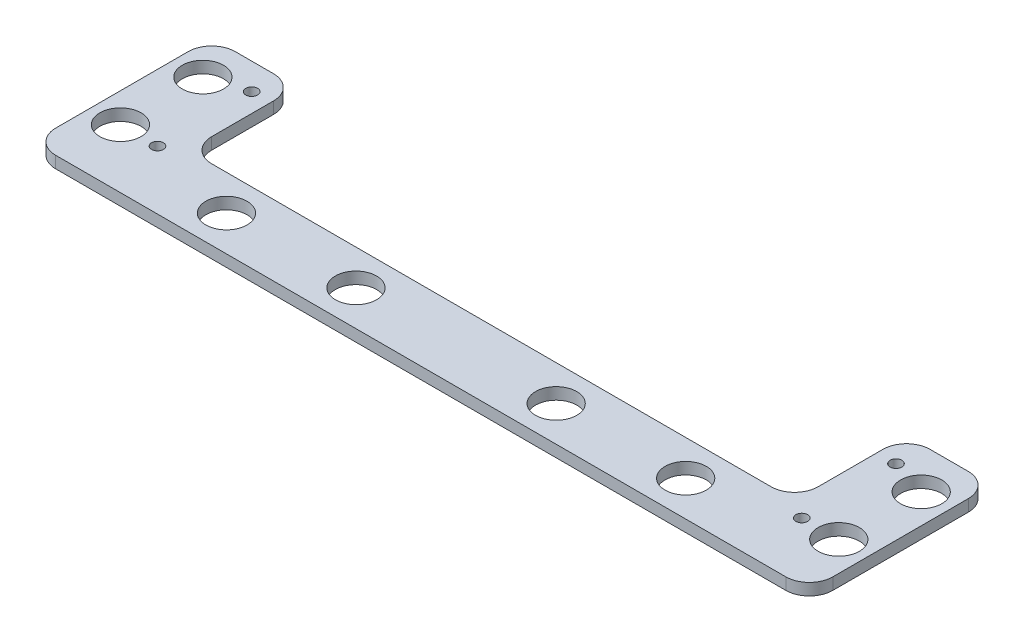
ISO-10303-21;
HEADER;
FILE_DESCRIPTION(('STEP AP214'),'2;1');
FILE_NAME('part.step','',(''),(''),'','','');
FILE_SCHEMA(('AUTOMOTIVE_DESIGN { 1 0 10303 214 1 1 1 1 }'));
ENDSEC;
DATA;
#1=APPLICATION_CONTEXT('core data for automotive mechanical design processes');
#2=APPLICATION_PROTOCOL_DEFINITION('international standard','automotive_design',2000,#1);
#3=PRODUCT_CONTEXT('',#1,'mechanical');
#4=PRODUCT('Part','Part','',(#3));
#5=PRODUCT_RELATED_PRODUCT_CATEGORY('part','',(#4));
#6=PRODUCT_DEFINITION_FORMATION('','',#4);
#7=PRODUCT_DEFINITION_CONTEXT('part definition',#1,'design');
#8=PRODUCT_DEFINITION('design','',#6,#7);
#9=PRODUCT_DEFINITION_SHAPE('','',#8);
#10=(LENGTH_UNIT() NAMED_UNIT(*) SI_UNIT(.MILLI.,.METRE.));
#11=(NAMED_UNIT(*) PLANE_ANGLE_UNIT() SI_UNIT($,.RADIAN.));
#12=(NAMED_UNIT(*) SI_UNIT($,.STERADIAN.) SOLID_ANGLE_UNIT());
#13=UNCERTAINTY_MEASURE_WITH_UNIT(LENGTH_MEASURE(1.E-05),#10,'distance_accuracy_value','');
#14=(GEOMETRIC_REPRESENTATION_CONTEXT(3) GLOBAL_UNCERTAINTY_ASSIGNED_CONTEXT((#13)) GLOBAL_UNIT_ASSIGNED_CONTEXT((#10,
#11,#12)) REPRESENTATION_CONTEXT('',''));
#15=CARTESIAN_POINT('',(0.,0.,0.));
#16=DIRECTION('',(0.,0.,1.));
#17=DIRECTION('',(1.,0.,0.));
#18=AXIS2_PLACEMENT_3D('',#15,#16,#17);
#19=CARTESIAN_POINT('',(704.85,12.7,-266.7));
#20=DIRECTION('',(0.,1.,0.));
#21=DIRECTION('',(0.,0.,1.));
#22=AXIS2_PLACEMENT_3D('',#19,#20,#21);
#23=PLANE('',#22);
#24=CARTESIAN_POINT('',(694.863233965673,12.7,-50.8));
#25=DIRECTION('',(0.,-1.,0.));
#26=DIRECTION('',(0.,0.,1.));
#27=AXIS2_PLACEMENT_3D('',#24,#25,#26);
#28=CIRCLE('',#27,12.7);
#29=CARTESIAN_POINT('',(694.863233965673,12.7,-38.1));
#30=VERTEX_POINT('',#29);
#31=EDGE_CURVE('E421',#30,#30,#28,.T.);
#32=ORIENTED_EDGE('',*,*,#31,.T.);
#33=EDGE_LOOP('',(#32));
#34=FACE_BOUND('',#33,.T.);
#35=CARTESIAN_POINT('',(-694.863233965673,12.7,-254.));
#36=DIRECTION('',(0.,1.,0.));
#37=DIRECTION('',(0.,0.,1.));
#38=AXIS2_PLACEMENT_3D('',#35,#36,#37);
#39=CIRCLE('',#38,12.7);
#40=CARTESIAN_POINT('',(-694.863233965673,12.7,-241.3));
#41=VERTEX_POINT('',#40);
#42=EDGE_CURVE('E428',#41,#41,#39,.T.);
#43=ORIENTED_EDGE('',*,*,#42,.F.);
#44=EDGE_LOOP('',(#43));
#45=FACE_BOUND('',#44,.T.);
#46=CARTESIAN_POINT('',(-694.863233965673,12.7,-50.8));
#47=DIRECTION('',(0.,1.,0.));
#48=DIRECTION('',(0.,0.,1.));
#49=AXIS2_PLACEMENT_3D('',#46,#47,#48);
#50=CIRCLE('',#49,12.7);
#51=CARTESIAN_POINT('',(-694.863233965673,12.7,-38.1));
#52=VERTEX_POINT('',#51);
#53=EDGE_CURVE('E434',#52,#52,#50,.T.);
#54=ORIENTED_EDGE('',*,*,#53,.F.);
#55=EDGE_LOOP('',(#54));
#56=FACE_BOUND('',#55,.T.);
#57=CARTESIAN_POINT('',(215.9,12.7,-2.22044604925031E-13));
#58=DIRECTION('',(0.,1.,0.));
#59=DIRECTION('',(0.,0.,1.));
#60=AXIS2_PLACEMENT_3D('',#57,#58,#59);
#61=CIRCLE('',#60,44.4500000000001);
#62=CARTESIAN_POINT('',(215.9,12.7,44.4499999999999));
#63=VERTEX_POINT('',#62);
#64=EDGE_CURVE('E449',#63,#63,#61,.T.);
#65=ORIENTED_EDGE('',*,*,#64,.F.);
#66=EDGE_LOOP('',(#65));
#67=FACE_BOUND('',#66,.T.);
#68=CARTESIAN_POINT('',(495.3,12.7,-2.22044604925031E-13));
#69=DIRECTION('',(0.,1.,0.));
#70=DIRECTION('',(0.,0.,1.));
#71=AXIS2_PLACEMENT_3D('',#68,#69,#70);
#72=CIRCLE('',#71,44.4500000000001);
#73=CARTESIAN_POINT('',(495.3,12.7,44.4499999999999));
#74=VERTEX_POINT('',#73);
#75=EDGE_CURVE('E461',#74,#74,#72,.T.);
#76=ORIENTED_EDGE('',*,*,#75,.F.);
#77=EDGE_LOOP('',(#76));
#78=FACE_BOUND('',#77,.T.);
#79=CARTESIAN_POINT('',(774.7,12.7,-50.8000000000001));
#80=DIRECTION('',(0.,1.,0.));
#81=DIRECTION('',(0.,0.,1.));
#82=AXIS2_PLACEMENT_3D('',#79,#80,#81);
#83=CIRCLE('',#82,44.45);
#84=CARTESIAN_POINT('',(774.7,12.7,-6.35000000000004));
#85=VERTEX_POINT('',#84);
#86=EDGE_CURVE('E473',#85,#85,#83,.T.);
#87=ORIENTED_EDGE('',*,*,#86,.F.);
#88=EDGE_LOOP('',(#87));
#89=FACE_BOUND('',#88,.T.);
#90=CARTESIAN_POINT('',(774.7,12.7,-228.6));
#91=DIRECTION('',(0.,1.,0.));
#92=DIRECTION('',(0.,0.,1.));
#93=AXIS2_PLACEMENT_3D('',#90,#91,#92);
#94=CIRCLE('',#93,44.45);
#95=CARTESIAN_POINT('',(774.7,12.7,-184.15));
#96=VERTEX_POINT('',#95);
#97=EDGE_CURVE('E180',#96,#96,#94,.T.);
#98=ORIENTED_EDGE('',*,*,#97,.F.);
#99=EDGE_LOOP('',(#98));
#100=FACE_BOUND('',#99,.T.);
#101=CARTESIAN_POINT('',(704.85,12.7,-266.7));
#102=DIRECTION('',(0.,1.,0.));
#103=DIRECTION('',(0.,0.,1.));
#104=AXIS2_PLACEMENT_3D('',#101,#102,#103);
#105=CIRCLE('',#104,50.8);
#106=CARTESIAN_POINT('',(704.85,12.7,-317.5));
#107=VERTEX_POINT('',#106);
#108=CARTESIAN_POINT('',(654.05,12.7,-266.7));
#109=VERTEX_POINT('',#108);
#110=EDGE_CURVE('E214',#107,#109,#105,.T.);
#111=ORIENTED_EDGE('',*,*,#110,.T.);
#112=DIRECTION('',(0.,0.,1.));
#113=VECTOR('',#112,1.);
#114=CARTESIAN_POINT('',(654.05,12.7,-266.7));
#115=LINE('',#114,#113);
#116=CARTESIAN_POINT('',(654.05,12.7,-127.));
#117=VERTEX_POINT('',#116);
#118=EDGE_CURVE('E175',#109,#117,#115,.T.);
#119=ORIENTED_EDGE('',*,*,#118,.T.);
#120=CARTESIAN_POINT('',(603.25,12.7,-127.));
#121=DIRECTION('',(0.,-1.,0.));
#122=DIRECTION('',(0.,0.,1.));
#123=AXIS2_PLACEMENT_3D('',#120,#121,#122);
#124=CIRCLE('',#123,50.7999999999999);
#125=CARTESIAN_POINT('',(603.25,12.7,-76.2000000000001));
#126=VERTEX_POINT('',#125);
#127=EDGE_CURVE('E217',#117,#126,#124,.T.);
#128=ORIENTED_EDGE('',*,*,#127,.T.);
#129=DIRECTION('',(-1.,0.,0.));
#130=VECTOR('',#129,1.);
#131=CARTESIAN_POINT('',(603.25,12.7,-76.2000000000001));
#132=LINE('',#131,#130);
#133=CARTESIAN_POINT('',(-603.25,12.7,-76.1999999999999));
#134=VERTEX_POINT('',#133);
#135=EDGE_CURVE('E219',#126,#134,#132,.T.);
#136=ORIENTED_EDGE('',*,*,#135,.T.);
#137=CARTESIAN_POINT('',(-603.25,12.7,-127.));
#138=DIRECTION('',(0.,-1.,0.));
#139=DIRECTION('',(0.,0.,-1.));
#140=AXIS2_PLACEMENT_3D('',#137,#138,#139);
#141=CIRCLE('',#140,50.8);
#142=CARTESIAN_POINT('',(-654.05,12.7,-127.));
#143=VERTEX_POINT('',#142);
#144=EDGE_CURVE('E221',#134,#143,#141,.T.);
#145=ORIENTED_EDGE('',*,*,#144,.T.);
#146=DIRECTION('',(0.,0.,-1.));
#147=VECTOR('',#146,1.);
#148=CARTESIAN_POINT('',(-654.05,12.7,-127.));
#149=LINE('',#148,#147);
#150=CARTESIAN_POINT('',(-654.05,12.7,-260.35));
#151=VERTEX_POINT('',#150);
#152=EDGE_CURVE('E223',#143,#151,#149,.T.);
#153=ORIENTED_EDGE('',*,*,#152,.T.);
#154=CARTESIAN_POINT('',(-704.85,12.7,-260.35));
#155=DIRECTION('',(0.,1.,0.));
#156=DIRECTION('',(0.,0.,1.));
#157=AXIS2_PLACEMENT_3D('',#154,#155,#156);
#158=CIRCLE('',#157,50.7999999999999);
#159=CARTESIAN_POINT('',(-704.85,12.7,-311.15));
#160=VERTEX_POINT('',#159);
#161=EDGE_CURVE('E225',#151,#160,#158,.T.);
#162=ORIENTED_EDGE('',*,*,#161,.T.);
#163=DIRECTION('',(-1.,0.,0.));
#164=VECTOR('',#163,1.);
#165=CARTESIAN_POINT('',(-704.85,12.7,-311.15));
#166=LINE('',#165,#164);
#167=CARTESIAN_POINT('',(-787.4,12.7,-311.15));
#168=VERTEX_POINT('',#167);
#169=EDGE_CURVE('E227',#160,#168,#166,.T.);
#170=ORIENTED_EDGE('',*,*,#169,.T.);
#171=CARTESIAN_POINT('',(-787.4,12.7,-260.35));
#172=DIRECTION('',(0.,1.,0.));
#173=DIRECTION('',(0.,0.,1.));
#174=AXIS2_PLACEMENT_3D('',#171,#172,#173);
#175=CIRCLE('',#174,50.8);
#176=CARTESIAN_POINT('',(-838.2,12.7,-260.35));
#177=VERTEX_POINT('',#176);
#178=EDGE_CURVE('E229',#168,#177,#175,.T.);
#179=ORIENTED_EDGE('',*,*,#178,.T.);
#180=DIRECTION('',(0.,0.,1.));
#181=VECTOR('',#180,1.);
#182=CARTESIAN_POINT('',(-838.2,12.7,-260.35));
#183=LINE('',#182,#181);
#184=CARTESIAN_POINT('',(-838.2,12.7,25.3999999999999));
#185=VERTEX_POINT('',#184);
#186=EDGE_CURVE('E231',#177,#185,#183,.T.);
#187=ORIENTED_EDGE('',*,*,#186,.T.);
#188=CARTESIAN_POINT('',(-787.4,12.7,25.3999999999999));
#189=DIRECTION('',(0.,1.,0.));
#190=DIRECTION('',(0.,0.,1.));
#191=AXIS2_PLACEMENT_3D('',#188,#189,#190);
#192=CIRCLE('',#191,50.8);
#193=CARTESIAN_POINT('',(-787.4,12.7,76.1999999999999));
#194=VERTEX_POINT('',#193);
#195=EDGE_CURVE('E233',#185,#194,#192,.T.);
#196=ORIENTED_EDGE('',*,*,#195,.T.);
#197=DIRECTION('',(1.,0.,0.));
#198=VECTOR('',#197,1.);
#199=CARTESIAN_POINT('',(-787.4,12.7,76.1999999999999));
#200=LINE('',#199,#198);
#201=CARTESIAN_POINT('',(787.4,12.7,76.1999999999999));
#202=VERTEX_POINT('',#201);
#203=EDGE_CURVE('E235',#194,#202,#200,.T.);
#204=ORIENTED_EDGE('',*,*,#203,.T.);
#205=CARTESIAN_POINT('',(787.4,12.7,25.3999999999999));
#206=DIRECTION('',(0.,1.,0.));
#207=DIRECTION('',(0.,0.,-1.));
#208=AXIS2_PLACEMENT_3D('',#205,#206,#207);
#209=CIRCLE('',#208,50.8);
#210=CARTESIAN_POINT('',(838.2,12.7,25.3999999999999));
#211=VERTEX_POINT('',#210);
#212=EDGE_CURVE('E237',#202,#211,#209,.T.);
#213=ORIENTED_EDGE('',*,*,#212,.T.);
#214=DIRECTION('',(0.,0.,-1.));
#215=VECTOR('',#214,1.);
#216=CARTESIAN_POINT('',(838.2,12.7,25.3999999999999));
#217=LINE('',#216,#215);
#218=CARTESIAN_POINT('',(838.2,12.7,-266.7));
#219=VERTEX_POINT('',#218);
#220=EDGE_CURVE('E239',#211,#219,#217,.T.);
#221=ORIENTED_EDGE('',*,*,#220,.T.);
#222=CARTESIAN_POINT('',(787.4,12.7,-266.7));
#223=DIRECTION('',(0.,1.,0.));
#224=DIRECTION('',(0.,0.,1.));
#225=AXIS2_PLACEMENT_3D('',#222,#223,#224);
#226=CIRCLE('',#225,50.7999999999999);
#227=CARTESIAN_POINT('',(787.4,12.7,-317.5));
#228=VERTEX_POINT('',#227);
#229=EDGE_CURVE('E68',#219,#228,#226,.T.);
#230=ORIENTED_EDGE('',*,*,#229,.T.);
#231=DIRECTION('',(-1.,0.,0.));
#232=VECTOR('',#231,1.);
#233=CARTESIAN_POINT('',(787.4,12.7,-317.5));
#234=LINE('',#233,#232);
#235=EDGE_CURVE('E63',#228,#107,#234,.T.);
#236=ORIENTED_EDGE('',*,*,#235,.T.);
#237=EDGE_LOOP('',(#111,#119,#128,#136,#145,#153,#162,#170,#179,#187,#196,#204,#213,#221,#230,#236));
#238=FACE_BOUND('',#237,.T.);
#239=CARTESIAN_POINT('',(-774.7,12.7,-228.6));
#240=DIRECTION('',(0.,1.,0.));
#241=DIRECTION('',(0.,0.,-1.));
#242=AXIS2_PLACEMENT_3D('',#239,#240,#241);
#243=CIRCLE('',#242,44.45);
#244=CARTESIAN_POINT('',(-774.7,12.7,-273.05));
#245=VERTEX_POINT('',#244);
#246=EDGE_CURVE('E479',#245,#245,#243,.T.);
#247=ORIENTED_EDGE('',*,*,#246,.F.);
#248=EDGE_LOOP('',(#247));
#249=FACE_BOUND('',#248,.T.);
#250=CARTESIAN_POINT('',(-774.7,12.7,-50.7999999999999));
#251=DIRECTION('',(0.,1.,0.));
#252=DIRECTION('',(0.,0.,-1.));
#253=AXIS2_PLACEMENT_3D('',#250,#251,#252);
#254=CIRCLE('',#253,44.45);
#255=CARTESIAN_POINT('',(-774.7,12.7,-95.2499999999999));
#256=VERTEX_POINT('',#255);
#257=EDGE_CURVE('E467',#256,#256,#254,.T.);
#258=ORIENTED_EDGE('',*,*,#257,.F.);
#259=EDGE_LOOP('',(#258));
#260=FACE_BOUND('',#259,.T.);
#261=CARTESIAN_POINT('',(-495.3,12.7,-1.00735099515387E-13));
#262=DIRECTION('',(0.,1.,0.));
#263=DIRECTION('',(0.,0.,-1.));
#264=AXIS2_PLACEMENT_3D('',#261,#262,#263);
#265=CIRCLE('',#264,44.45);
#266=CARTESIAN_POINT('',(-495.3,12.7,-44.4500000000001));
#267=VERTEX_POINT('',#266);
#268=EDGE_CURVE('E455',#267,#267,#265,.T.);
#269=ORIENTED_EDGE('',*,*,#268,.F.);
#270=EDGE_LOOP('',(#269));
#271=FACE_BOUND('',#270,.T.);
#272=CARTESIAN_POINT('',(-215.9,12.7,-1.69166102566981E-13));
#273=DIRECTION('',(0.,1.,0.));
#274=DIRECTION('',(0.,0.,-1.));
#275=AXIS2_PLACEMENT_3D('',#272,#273,#274);
#276=CIRCLE('',#275,44.45);
#277=CARTESIAN_POINT('',(-215.9,12.7,-44.4500000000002));
#278=VERTEX_POINT('',#277);
#279=EDGE_CURVE('E443',#278,#278,#276,.T.);
#280=ORIENTED_EDGE('',*,*,#279,.F.);
#281=EDGE_LOOP('',(#280));
#282=FACE_BOUND('',#281,.T.);
#283=CARTESIAN_POINT('',(694.863233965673,12.7,-254.));
#284=DIRECTION('',(0.,-1.,0.));
#285=DIRECTION('',(0.,0.,1.));
#286=AXIS2_PLACEMENT_3D('',#283,#284,#285);
#287=CIRCLE('',#286,12.7);
#288=CARTESIAN_POINT('',(694.863233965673,12.7,-241.3));
#289=VERTEX_POINT('',#288);
#290=EDGE_CURVE('E418',#289,#289,#287,.T.);
#291=ORIENTED_EDGE('',*,*,#290,.T.);
#292=EDGE_LOOP('',(#291));
#293=FACE_BOUND('',#292,.T.);
#294=ADVANCED_FACE('F48',(#34,#45,#56,#67,#78,#89,#100,#238,#249,#260,#271,#282,#293),#23,.T.);
#295=CARTESIAN_POINT('',(704.85,-12.7,-266.7));
#296=DIRECTION('',(0.,1.,0.));
#297=DIRECTION('',(0.,0.,1.));
#298=AXIS2_PLACEMENT_3D('',#295,#296,#297);
#299=PLANE('',#298);
#300=CARTESIAN_POINT('',(694.863233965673,-12.7,-50.8));
#301=DIRECTION('',(0.,-1.,0.));
#302=DIRECTION('',(0.,0.,1.));
#303=AXIS2_PLACEMENT_3D('',#300,#301,#302);
#304=CIRCLE('',#303,12.7);
#305=CARTESIAN_POINT('',(694.863233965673,-12.7,-38.1));
#306=VERTEX_POINT('',#305);
#307=EDGE_CURVE('E425',#306,#306,#304,.T.);
#308=ORIENTED_EDGE('',*,*,#307,.F.);
#309=EDGE_LOOP('',(#308));
#310=FACE_BOUND('',#309,.T.);
#311=CARTESIAN_POINT('',(-694.863233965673,-12.7,-254.));
#312=DIRECTION('',(0.,1.,0.));
#313=DIRECTION('',(0.,0.,1.));
#314=AXIS2_PLACEMENT_3D('',#311,#312,#313);
#315=CIRCLE('',#314,12.7);
#316=CARTESIAN_POINT('',(-694.863233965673,-12.7,-241.3));
#317=VERTEX_POINT('',#316);
#318=EDGE_CURVE('E431',#317,#317,#315,.T.);
#319=ORIENTED_EDGE('',*,*,#318,.T.);
#320=EDGE_LOOP('',(#319));
#321=FACE_BOUND('',#320,.T.);
#322=CARTESIAN_POINT('',(-694.863233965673,-12.7,-50.8));
#323=DIRECTION('',(0.,1.,0.));
#324=DIRECTION('',(0.,0.,1.));
#325=AXIS2_PLACEMENT_3D('',#322,#323,#324);
#326=CIRCLE('',#325,12.7);
#327=CARTESIAN_POINT('',(-694.863233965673,-12.7,-38.1));
#328=VERTEX_POINT('',#327);
#329=EDGE_CURVE('E437',#328,#328,#326,.T.);
#330=ORIENTED_EDGE('',*,*,#329,.T.);
#331=EDGE_LOOP('',(#330));
#332=FACE_BOUND('',#331,.T.);
#333=CARTESIAN_POINT('',(215.9,-12.7,-2.22044604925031E-13));
#334=DIRECTION('',(0.,1.,0.));
#335=DIRECTION('',(0.,0.,1.));
#336=AXIS2_PLACEMENT_3D('',#333,#334,#335);
#337=CIRCLE('',#336,44.4500000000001);
#338=CARTESIAN_POINT('',(215.9,-12.7,44.4499999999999));
#339=VERTEX_POINT('',#338);
#340=EDGE_CURVE('E446',#339,#339,#337,.T.);
#341=ORIENTED_EDGE('',*,*,#340,.T.);
#342=EDGE_LOOP('',(#341));
#343=FACE_BOUND('',#342,.T.);
#344=CARTESIAN_POINT('',(495.3,-12.7,-2.22044604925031E-13));
#345=DIRECTION('',(0.,1.,0.));
#346=DIRECTION('',(0.,0.,1.));
#347=AXIS2_PLACEMENT_3D('',#344,#345,#346);
#348=CIRCLE('',#347,44.4500000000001);
#349=CARTESIAN_POINT('',(495.3,-12.7,44.4499999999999));
#350=VERTEX_POINT('',#349);
#351=EDGE_CURVE('E458',#350,#350,#348,.T.);
#352=ORIENTED_EDGE('',*,*,#351,.T.);
#353=EDGE_LOOP('',(#352));
#354=FACE_BOUND('',#353,.T.);
#355=CARTESIAN_POINT('',(774.7,-12.7,-50.8000000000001));
#356=DIRECTION('',(0.,1.,0.));
#357=DIRECTION('',(0.,0.,1.));
#358=AXIS2_PLACEMENT_3D('',#355,#356,#357);
#359=CIRCLE('',#358,44.45);
#360=CARTESIAN_POINT('',(774.7,-12.7,-6.35000000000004));
#361=VERTEX_POINT('',#360);
#362=EDGE_CURVE('E470',#361,#361,#359,.T.);
#363=ORIENTED_EDGE('',*,*,#362,.T.);
#364=EDGE_LOOP('',(#363));
#365=FACE_BOUND('',#364,.T.);
#366=CARTESIAN_POINT('',(774.7,-12.7,-228.6));
#367=DIRECTION('',(0.,1.,0.));
#368=DIRECTION('',(0.,0.,1.));
#369=AXIS2_PLACEMENT_3D('',#366,#367,#368);
#370=CIRCLE('',#369,44.45);
#371=CARTESIAN_POINT('',(774.7,-12.7,-184.15));
#372=VERTEX_POINT('',#371);
#373=EDGE_CURVE('E183',#372,#372,#370,.T.);
#374=ORIENTED_EDGE('',*,*,#373,.T.);
#375=EDGE_LOOP('',(#374));
#376=FACE_BOUND('',#375,.T.);
#377=CARTESIAN_POINT('',(704.85,-12.7,-266.7));
#378=DIRECTION('',(0.,1.,0.));
#379=DIRECTION('',(0.,0.,1.));
#380=AXIS2_PLACEMENT_3D('',#377,#378,#379);
#381=CIRCLE('',#380,50.8);
#382=CARTESIAN_POINT('',(704.85,-12.7,-317.5));
#383=VERTEX_POINT('',#382);
#384=CARTESIAN_POINT('',(654.05,-12.7,-266.7));
#385=VERTEX_POINT('',#384);
#386=EDGE_CURVE('E166',#383,#385,#381,.T.);
#387=ORIENTED_EDGE('',*,*,#386,.F.);
#388=DIRECTION('',(-1.,0.,0.));
#389=VECTOR('',#388,1.);
#390=CARTESIAN_POINT('',(787.4,-12.7,-317.5));
#391=LINE('',#390,#389);
#392=CARTESIAN_POINT('',(787.4,-12.7,-317.5));
#393=VERTEX_POINT('',#392);
#394=EDGE_CURVE('E212',#393,#383,#391,.T.);
#395=ORIENTED_EDGE('',*,*,#394,.F.);
#396=CARTESIAN_POINT('',(787.4,-12.7,-266.7));
#397=DIRECTION('',(0.,1.,0.));
#398=DIRECTION('',(0.,0.,1.));
#399=AXIS2_PLACEMENT_3D('',#396,#397,#398);
#400=CIRCLE('',#399,50.7999999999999);
#401=CARTESIAN_POINT('',(838.2,-12.7,-266.7));
#402=VERTEX_POINT('',#401);
#403=EDGE_CURVE('E210',#402,#393,#400,.T.);
#404=ORIENTED_EDGE('',*,*,#403,.F.);
#405=DIRECTION('',(0.,0.,-1.));
#406=VECTOR('',#405,1.);
#407=CARTESIAN_POINT('',(838.2,-12.7,25.3999999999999));
#408=LINE('',#407,#406);
#409=CARTESIAN_POINT('',(838.2,-12.7,25.3999999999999));
#410=VERTEX_POINT('',#409);
#411=EDGE_CURVE('E208',#410,#402,#408,.T.);
#412=ORIENTED_EDGE('',*,*,#411,.F.);
#413=CARTESIAN_POINT('',(787.4,-12.7,25.3999999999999));
#414=DIRECTION('',(0.,1.,0.));
#415=DIRECTION('',(0.,0.,-1.));
#416=AXIS2_PLACEMENT_3D('',#413,#414,#415);
#417=CIRCLE('',#416,50.8);
#418=CARTESIAN_POINT('',(787.4,-12.7,76.1999999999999));
#419=VERTEX_POINT('',#418);
#420=EDGE_CURVE('E206',#419,#410,#417,.T.);
#421=ORIENTED_EDGE('',*,*,#420,.F.);
#422=DIRECTION('',(1.,0.,0.));
#423=VECTOR('',#422,1.);
#424=CARTESIAN_POINT('',(-787.4,-12.7,76.1999999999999));
#425=LINE('',#424,#423);
#426=CARTESIAN_POINT('',(-787.4,-12.7,76.1999999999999));
#427=VERTEX_POINT('',#426);
#428=EDGE_CURVE('E204',#427,#419,#425,.T.);
#429=ORIENTED_EDGE('',*,*,#428,.F.);
#430=CARTESIAN_POINT('',(-787.4,-12.7,25.3999999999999));
#431=DIRECTION('',(0.,1.,0.));
#432=DIRECTION('',(0.,0.,1.));
#433=AXIS2_PLACEMENT_3D('',#430,#431,#432);
#434=CIRCLE('',#433,50.8);
#435=CARTESIAN_POINT('',(-838.2,-12.7,25.3999999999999));
#436=VERTEX_POINT('',#435);
#437=EDGE_CURVE('E202',#436,#427,#434,.T.);
#438=ORIENTED_EDGE('',*,*,#437,.F.);
#439=DIRECTION('',(0.,0.,1.));
#440=VECTOR('',#439,1.);
#441=CARTESIAN_POINT('',(-838.2,-12.7,-260.35));
#442=LINE('',#441,#440);
#443=CARTESIAN_POINT('',(-838.2,-12.7,-260.35));
#444=VERTEX_POINT('',#443);
#445=EDGE_CURVE('E200',#444,#436,#442,.T.);
#446=ORIENTED_EDGE('',*,*,#445,.F.);
#447=CARTESIAN_POINT('',(-787.4,-12.7,-260.35));
#448=DIRECTION('',(0.,1.,0.));
#449=DIRECTION('',(0.,0.,1.));
#450=AXIS2_PLACEMENT_3D('',#447,#448,#449);
#451=CIRCLE('',#450,50.8);
#452=CARTESIAN_POINT('',(-787.4,-12.7,-311.15));
#453=VERTEX_POINT('',#452);
#454=EDGE_CURVE('E198',#453,#444,#451,.T.);
#455=ORIENTED_EDGE('',*,*,#454,.F.);
#456=DIRECTION('',(-1.,0.,0.));
#457=VECTOR('',#456,1.);
#458=CARTESIAN_POINT('',(-704.85,-12.7,-311.15));
#459=LINE('',#458,#457);
#460=CARTESIAN_POINT('',(-704.85,-12.7,-311.15));
#461=VERTEX_POINT('',#460);
#462=EDGE_CURVE('E196',#461,#453,#459,.T.);
#463=ORIENTED_EDGE('',*,*,#462,.F.);
#464=CARTESIAN_POINT('',(-704.85,-12.7,-260.35));
#465=DIRECTION('',(0.,1.,0.));
#466=DIRECTION('',(0.,0.,1.));
#467=AXIS2_PLACEMENT_3D('',#464,#465,#466);
#468=CIRCLE('',#467,50.7999999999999);
#469=CARTESIAN_POINT('',(-654.05,-12.7,-260.35));
#470=VERTEX_POINT('',#469);
#471=EDGE_CURVE('E194',#470,#461,#468,.T.);
#472=ORIENTED_EDGE('',*,*,#471,.F.);
#473=DIRECTION('',(0.,0.,-1.));
#474=VECTOR('',#473,1.);
#475=CARTESIAN_POINT('',(-654.05,-12.7,-127.));
#476=LINE('',#475,#474);
#477=CARTESIAN_POINT('',(-654.05,-12.7,-127.));
#478=VERTEX_POINT('',#477);
#479=EDGE_CURVE('E192',#478,#470,#476,.T.);
#480=ORIENTED_EDGE('',*,*,#479,.F.);
#481=CARTESIAN_POINT('',(-603.25,-12.7,-127.));
#482=DIRECTION('',(0.,-1.,0.));
#483=DIRECTION('',(0.,0.,-1.));
#484=AXIS2_PLACEMENT_3D('',#481,#482,#483);
#485=CIRCLE('',#484,50.8);
#486=CARTESIAN_POINT('',(-603.25,-12.7,-76.1999999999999));
#487=VERTEX_POINT('',#486);
#488=EDGE_CURVE('E190',#487,#478,#485,.T.);
#489=ORIENTED_EDGE('',*,*,#488,.F.);
#490=DIRECTION('',(-1.,0.,0.));
#491=VECTOR('',#490,1.);
#492=CARTESIAN_POINT('',(603.25,-12.7,-76.2000000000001));
#493=LINE('',#492,#491);
#494=CARTESIAN_POINT('',(603.25,-12.7,-76.2000000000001));
#495=VERTEX_POINT('',#494);
#496=EDGE_CURVE('E188',#495,#487,#493,.T.);
#497=ORIENTED_EDGE('',*,*,#496,.F.);
#498=CARTESIAN_POINT('',(603.25,-12.7,-127.));
#499=DIRECTION('',(0.,-1.,0.));
#500=DIRECTION('',(0.,0.,1.));
#501=AXIS2_PLACEMENT_3D('',#498,#499,#500);
#502=CIRCLE('',#501,50.7999999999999);
#503=CARTESIAN_POINT('',(654.05,-12.7,-127.));
#504=VERTEX_POINT('',#503);
#505=EDGE_CURVE('E168',#504,#495,#502,.T.);
#506=ORIENTED_EDGE('',*,*,#505,.F.);
#507=DIRECTION('',(0.,0.,1.));
#508=VECTOR('',#507,1.);
#509=CARTESIAN_POINT('',(654.05,-12.7,-266.7));
#510=LINE('',#509,#508);
#511=EDGE_CURVE('E161',#385,#504,#510,.T.);
#512=ORIENTED_EDGE('',*,*,#511,.F.);
#513=EDGE_LOOP('',(#387,#395,#404,#412,#421,#429,#438,#446,#455,#463,#472,#480,#489,#497,#506,#512));
#514=FACE_BOUND('',#513,.T.);
#515=CARTESIAN_POINT('',(-774.7,-12.7,-228.6));
#516=DIRECTION('',(0.,1.,0.));
#517=DIRECTION('',(0.,0.,-1.));
#518=AXIS2_PLACEMENT_3D('',#515,#516,#517);
#519=CIRCLE('',#518,44.45);
#520=CARTESIAN_POINT('',(-774.7,-12.7,-273.05));
#521=VERTEX_POINT('',#520);
#522=EDGE_CURVE('E476',#521,#521,#519,.T.);
#523=ORIENTED_EDGE('',*,*,#522,.T.);
#524=EDGE_LOOP('',(#523));
#525=FACE_BOUND('',#524,.T.);
#526=CARTESIAN_POINT('',(-774.7,-12.7,-50.7999999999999));
#527=DIRECTION('',(0.,1.,0.));
#528=DIRECTION('',(0.,0.,-1.));
#529=AXIS2_PLACEMENT_3D('',#526,#527,#528);
#530=CIRCLE('',#529,44.45);
#531=CARTESIAN_POINT('',(-774.7,-12.7,-95.2499999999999));
#532=VERTEX_POINT('',#531);
#533=EDGE_CURVE('E464',#532,#532,#530,.T.);
#534=ORIENTED_EDGE('',*,*,#533,.T.);
#535=EDGE_LOOP('',(#534));
#536=FACE_BOUND('',#535,.T.);
#537=CARTESIAN_POINT('',(-495.3,-12.7,-1.00735099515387E-13));
#538=DIRECTION('',(0.,1.,0.));
#539=DIRECTION('',(0.,0.,-1.));
#540=AXIS2_PLACEMENT_3D('',#537,#538,#539);
#541=CIRCLE('',#540,44.45);
#542=CARTESIAN_POINT('',(-495.3,-12.7,-44.4500000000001));
#543=VERTEX_POINT('',#542);
#544=EDGE_CURVE('E452',#543,#543,#541,.T.);
#545=ORIENTED_EDGE('',*,*,#544,.T.);
#546=EDGE_LOOP('',(#545));
#547=FACE_BOUND('',#546,.T.);
#548=CARTESIAN_POINT('',(-215.9,-12.7,-1.69166102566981E-13));
#549=DIRECTION('',(0.,1.,0.));
#550=DIRECTION('',(0.,0.,-1.));
#551=AXIS2_PLACEMENT_3D('',#548,#549,#550);
#552=CIRCLE('',#551,44.45);
#553=CARTESIAN_POINT('',(-215.9,-12.7,-44.4500000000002));
#554=VERTEX_POINT('',#553);
#555=EDGE_CURVE('E440',#554,#554,#552,.T.);
#556=ORIENTED_EDGE('',*,*,#555,.T.);
#557=EDGE_LOOP('',(#556));
#558=FACE_BOUND('',#557,.T.);
#559=CARTESIAN_POINT('',(694.863233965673,-12.7,-254.));
#560=DIRECTION('',(0.,-1.,0.));
#561=DIRECTION('',(0.,0.,1.));
#562=AXIS2_PLACEMENT_3D('',#559,#560,#561);
#563=CIRCLE('',#562,12.7);
#564=CARTESIAN_POINT('',(694.863233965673,-12.7,-241.3));
#565=VERTEX_POINT('',#564);
#566=EDGE_CURVE('E415',#565,#565,#563,.T.);
#567=ORIENTED_EDGE('',*,*,#566,.F.);
#568=EDGE_LOOP('',(#567));
#569=FACE_BOUND('',#568,.T.);
#570=ADVANCED_FACE('F162',(#310,#321,#332,#343,#354,#365,#376,#514,#525,#536,#547,#558,#569),
#299,.F.);
#571=CARTESIAN_POINT('',(704.85,12.7,-266.7));
#572=DIRECTION('',(0.,-1.,0.));
#573=DIRECTION('',(0.,0.,-1.));
#574=AXIS2_PLACEMENT_3D('',#571,#572,#573);
#575=CYLINDRICAL_SURFACE('',#574,50.8);
#576=ORIENTED_EDGE('',*,*,#386,.T.);
#577=DIRECTION('',(0.,-1.,0.));
#578=VECTOR('',#577,1.);
#579=CARTESIAN_POINT('',(654.05,12.7,-266.7));
#580=LINE('',#579,#578);
#581=EDGE_CURVE('E13',#109,#385,#580,.T.);
#582=ORIENTED_EDGE('',*,*,#581,.F.);
#583=ORIENTED_EDGE('',*,*,#110,.F.);
#584=DIRECTION('',(0.,-1.,0.));
#585=VECTOR('',#584,1.);
#586=CARTESIAN_POINT('',(704.85,12.7,-317.5));
#587=LINE('',#586,#585);
#588=EDGE_CURVE('E179',#107,#383,#587,.T.);
#589=ORIENTED_EDGE('',*,*,#588,.T.);
#590=EDGE_LOOP('',(#576,#582,#583,#589));
#591=FACE_BOUND('',#590,.T.);
#592=ADVANCED_FACE('F50',(#591),#575,.T.);
#593=CARTESIAN_POINT('',(654.05,12.7,-266.7));
#594=DIRECTION('',(1.,0.,0.));
#595=DIRECTION('',(0.,0.,-1.));
#596=AXIS2_PLACEMENT_3D('',#593,#594,#595);
#597=PLANE('',#596);
#598=ORIENTED_EDGE('',*,*,#511,.T.);
#599=DIRECTION('',(0.,-1.,0.));
#600=VECTOR('',#599,1.);
#601=CARTESIAN_POINT('',(654.05,12.7,-127.));
#602=LINE('',#601,#600);
#603=EDGE_CURVE('E56',#117,#504,#602,.T.);
#604=ORIENTED_EDGE('',*,*,#603,.F.);
#605=ORIENTED_EDGE('',*,*,#118,.F.);
#606=ORIENTED_EDGE('',*,*,#581,.T.);
#607=EDGE_LOOP('',(#598,#604,#605,#606));
#608=FACE_BOUND('',#607,.T.);
#609=ADVANCED_FACE('F174',(#608),#597,.F.);
#610=CARTESIAN_POINT('',(603.25,12.7,-127.));
#611=DIRECTION('',(0.,-1.,0.));
#612=DIRECTION('',(0.,0.,-1.));
#613=AXIS2_PLACEMENT_3D('',#610,#611,#612);
#614=CYLINDRICAL_SURFACE('',#613,50.7999999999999);
#615=ORIENTED_EDGE('',*,*,#505,.T.);
#616=DIRECTION('',(0.,-1.,0.));
#617=VECTOR('',#616,1.);
#618=CARTESIAN_POINT('',(603.25,12.7,-76.2000000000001));
#619=LINE('',#618,#617);
#620=EDGE_CURVE('E280',#126,#495,#619,.T.);
#621=ORIENTED_EDGE('',*,*,#620,.F.);
#622=ORIENTED_EDGE('',*,*,#127,.F.);
#623=ORIENTED_EDGE('',*,*,#603,.T.);
#624=EDGE_LOOP('',(#615,#621,#622,#623));
#625=FACE_BOUND('',#624,.T.);
#626=ADVANCED_FACE('F284',(#625),#614,.F.);
#627=CARTESIAN_POINT('',(603.25,12.7,-76.2000000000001));
#628=DIRECTION('',(0.,0.,1.));
#629=DIRECTION('',(1.,0.,0.));
#630=AXIS2_PLACEMENT_3D('',#627,#628,#629);
#631=PLANE('',#630);
#632=ORIENTED_EDGE('',*,*,#496,.T.);
#633=DIRECTION('',(0.,-1.,0.));
#634=VECTOR('',#633,1.);
#635=CARTESIAN_POINT('',(-603.25,12.7,-76.1999999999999));
#636=LINE('',#635,#634);
#637=EDGE_CURVE('E277',#134,#487,#636,.T.);
#638=ORIENTED_EDGE('',*,*,#637,.F.);
#639=ORIENTED_EDGE('',*,*,#135,.F.);
#640=ORIENTED_EDGE('',*,*,#620,.T.);
#641=EDGE_LOOP('',(#632,#638,#639,#640));
#642=FACE_BOUND('',#641,.T.);
#643=ADVANCED_FACE('F292',(#642),#631,.F.);
#644=CARTESIAN_POINT('',(-603.25,12.7,-127.));
#645=DIRECTION('',(0.,-1.,0.));
#646=DIRECTION('',(0.,0.,-1.));
#647=AXIS2_PLACEMENT_3D('',#644,#645,#646);
#648=CYLINDRICAL_SURFACE('',#647,50.8);
#649=ORIENTED_EDGE('',*,*,#488,.T.);
#650=DIRECTION('',(0.,-1.,0.));
#651=VECTOR('',#650,1.);
#652=CARTESIAN_POINT('',(-654.05,12.7,-127.));
#653=LINE('',#652,#651);
#654=EDGE_CURVE('E274',#143,#478,#653,.T.);
#655=ORIENTED_EDGE('',*,*,#654,.F.);
#656=ORIENTED_EDGE('',*,*,#144,.F.);
#657=ORIENTED_EDGE('',*,*,#637,.T.);
#658=EDGE_LOOP('',(#649,#655,#656,#657));
#659=FACE_BOUND('',#658,.T.);
#660=ADVANCED_FACE('F295',(#659),#648,.F.);
#661=CARTESIAN_POINT('',(-654.05,12.7,-127.));
#662=DIRECTION('',(-1.,0.,0.));
#663=DIRECTION('',(0.,0.,1.));
#664=AXIS2_PLACEMENT_3D('',#661,#662,#663);
#665=PLANE('',#664);
#666=ORIENTED_EDGE('',*,*,#479,.T.);
#667=DIRECTION('',(0.,-1.,0.));
#668=VECTOR('',#667,1.);
#669=CARTESIAN_POINT('',(-654.05,12.7,-260.35));
#670=LINE('',#669,#668);
#671=EDGE_CURVE('E271',#151,#470,#670,.T.);
#672=ORIENTED_EDGE('',*,*,#671,.F.);
#673=ORIENTED_EDGE('',*,*,#152,.F.);
#674=ORIENTED_EDGE('',*,*,#654,.T.);
#675=EDGE_LOOP('',(#666,#672,#673,#674));
#676=FACE_BOUND('',#675,.T.);
#677=ADVANCED_FACE('F300',(#676),#665,.F.);
#678=CARTESIAN_POINT('',(-704.85,12.7,-260.35));
#679=DIRECTION('',(0.,-1.,0.));
#680=DIRECTION('',(0.,0.,-1.));
#681=AXIS2_PLACEMENT_3D('',#678,#679,#680);
#682=CYLINDRICAL_SURFACE('',#681,50.7999999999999);
#683=ORIENTED_EDGE('',*,*,#471,.T.);
#684=DIRECTION('',(0.,-1.,0.));
#685=VECTOR('',#684,1.);
#686=CARTESIAN_POINT('',(-704.85,12.7,-311.15));
#687=LINE('',#686,#685);
#688=EDGE_CURVE('E268',#160,#461,#687,.T.);
#689=ORIENTED_EDGE('',*,*,#688,.F.);
#690=ORIENTED_EDGE('',*,*,#161,.F.);
#691=ORIENTED_EDGE('',*,*,#671,.T.);
#692=EDGE_LOOP('',(#683,#689,#690,#691));
#693=FACE_BOUND('',#692,.T.);
#694=ADVANCED_FACE('F306',(#693),#682,.T.);
#695=CARTESIAN_POINT('',(-704.85,12.7,-311.15));
#696=DIRECTION('',(0.,0.,1.));
#697=DIRECTION('',(1.,0.,0.));
#698=AXIS2_PLACEMENT_3D('',#695,#696,#697);
#699=PLANE('',#698);
#700=ORIENTED_EDGE('',*,*,#462,.T.);
#701=DIRECTION('',(0.,-1.,0.));
#702=VECTOR('',#701,1.);
#703=CARTESIAN_POINT('',(-787.4,12.7,-311.15));
#704=LINE('',#703,#702);
#705=EDGE_CURVE('E265',#168,#453,#704,.T.);
#706=ORIENTED_EDGE('',*,*,#705,.F.);
#707=ORIENTED_EDGE('',*,*,#169,.F.);
#708=ORIENTED_EDGE('',*,*,#688,.T.);
#709=EDGE_LOOP('',(#700,#706,#707,#708));
#710=FACE_BOUND('',#709,.T.);
#711=ADVANCED_FACE('F310',(#710),#699,.F.);
#712=CARTESIAN_POINT('',(-787.4,12.7,-260.35));
#713=DIRECTION('',(0.,-1.,0.));
#714=DIRECTION('',(0.,0.,-1.));
#715=AXIS2_PLACEMENT_3D('',#712,#713,#714);
#716=CYLINDRICAL_SURFACE('',#715,50.8);
#717=ORIENTED_EDGE('',*,*,#454,.T.);
#718=DIRECTION('',(0.,-1.,0.));
#719=VECTOR('',#718,1.);
#720=CARTESIAN_POINT('',(-838.2,12.7,-260.35));
#721=LINE('',#720,#719);
#722=EDGE_CURVE('E262',#177,#444,#721,.T.);
#723=ORIENTED_EDGE('',*,*,#722,.F.);
#724=ORIENTED_EDGE('',*,*,#178,.F.);
#725=ORIENTED_EDGE('',*,*,#705,.T.);
#726=EDGE_LOOP('',(#717,#723,#724,#725));
#727=FACE_BOUND('',#726,.T.);
#728=ADVANCED_FACE('F315',(#727),#716,.T.);
#729=CARTESIAN_POINT('',(-838.2,12.7,-260.35));
#730=DIRECTION('',(1.,0.,0.));
#731=DIRECTION('',(0.,0.,-1.));
#732=AXIS2_PLACEMENT_3D('',#729,#730,#731);
#733=PLANE('',#732);
#734=ORIENTED_EDGE('',*,*,#445,.T.);
#735=DIRECTION('',(0.,-1.,0.));
#736=VECTOR('',#735,1.);
#737=CARTESIAN_POINT('',(-838.2,12.7,25.3999999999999));
#738=LINE('',#737,#736);
#739=EDGE_CURVE('E259',#185,#436,#738,.T.);
#740=ORIENTED_EDGE('',*,*,#739,.F.);
#741=ORIENTED_EDGE('',*,*,#186,.F.);
#742=ORIENTED_EDGE('',*,*,#722,.T.);
#743=EDGE_LOOP('',(#734,#740,#741,#742));
#744=FACE_BOUND('',#743,.T.);
#745=ADVANCED_FACE('F321',(#744),#733,.F.);
#746=CARTESIAN_POINT('',(-787.4,12.7,25.3999999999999));
#747=DIRECTION('',(0.,-1.,0.));
#748=DIRECTION('',(0.,0.,-1.));
#749=AXIS2_PLACEMENT_3D('',#746,#747,#748);
#750=CYLINDRICAL_SURFACE('',#749,50.8);
#751=ORIENTED_EDGE('',*,*,#437,.T.);
#752=DIRECTION('',(0.,-1.,0.));
#753=VECTOR('',#752,1.);
#754=CARTESIAN_POINT('',(-787.4,12.7,76.1999999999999));
#755=LINE('',#754,#753);
#756=EDGE_CURVE('E256',#194,#427,#755,.T.);
#757=ORIENTED_EDGE('',*,*,#756,.F.);
#758=ORIENTED_EDGE('',*,*,#195,.F.);
#759=ORIENTED_EDGE('',*,*,#739,.T.);
#760=EDGE_LOOP('',(#751,#757,#758,#759));
#761=FACE_BOUND('',#760,.T.);
#762=ADVANCED_FACE('F325',(#761),#750,.T.);
#763=CARTESIAN_POINT('',(-787.4,12.7,76.1999999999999));
#764=DIRECTION('',(0.,0.,-1.));
#765=DIRECTION('',(-1.,0.,0.));
#766=AXIS2_PLACEMENT_3D('',#763,#764,#765);
#767=PLANE('',#766);
#768=ORIENTED_EDGE('',*,*,#428,.T.);
#769=DIRECTION('',(0.,-1.,0.));
#770=VECTOR('',#769,1.);
#771=CARTESIAN_POINT('',(787.4,12.7,76.1999999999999));
#772=LINE('',#771,#770);
#773=EDGE_CURVE('E253',#202,#419,#772,.T.);
#774=ORIENTED_EDGE('',*,*,#773,.F.);
#775=ORIENTED_EDGE('',*,*,#203,.F.);
#776=ORIENTED_EDGE('',*,*,#756,.T.);
#777=EDGE_LOOP('',(#768,#774,#775,#776));
#778=FACE_BOUND('',#777,.T.);
#779=ADVANCED_FACE('F330',(#778),#767,.F.);
#780=CARTESIAN_POINT('',(787.4,12.7,25.3999999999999));
#781=DIRECTION('',(0.,-1.,0.));
#782=DIRECTION('',(0.,0.,-1.));
#783=AXIS2_PLACEMENT_3D('',#780,#781,#782);
#784=CYLINDRICAL_SURFACE('',#783,50.8);
#785=ORIENTED_EDGE('',*,*,#420,.T.);
#786=DIRECTION('',(0.,-1.,0.));
#787=VECTOR('',#786,1.);
#788=CARTESIAN_POINT('',(838.2,12.7,25.3999999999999));
#789=LINE('',#788,#787);
#790=EDGE_CURVE('E250',#211,#410,#789,.T.);
#791=ORIENTED_EDGE('',*,*,#790,.F.);
#792=ORIENTED_EDGE('',*,*,#212,.F.);
#793=ORIENTED_EDGE('',*,*,#773,.T.);
#794=EDGE_LOOP('',(#785,#791,#792,#793));
#795=FACE_BOUND('',#794,.T.);
#796=ADVANCED_FACE('F336',(#795),#784,.T.);
#797=CARTESIAN_POINT('',(838.2,12.7,25.3999999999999));
#798=DIRECTION('',(-1.,0.,0.));
#799=DIRECTION('',(0.,0.,1.));
#800=AXIS2_PLACEMENT_3D('',#797,#798,#799);
#801=PLANE('',#800);
#802=ORIENTED_EDGE('',*,*,#411,.T.);
#803=DIRECTION('',(0.,-1.,0.));
#804=VECTOR('',#803,1.);
#805=CARTESIAN_POINT('',(838.2,12.7,-266.7));
#806=LINE('',#805,#804);
#807=EDGE_CURVE('E247',#219,#402,#806,.T.);
#808=ORIENTED_EDGE('',*,*,#807,.F.);
#809=ORIENTED_EDGE('',*,*,#220,.F.);
#810=ORIENTED_EDGE('',*,*,#790,.T.);
#811=EDGE_LOOP('',(#802,#808,#809,#810));
#812=FACE_BOUND('',#811,.T.);
#813=ADVANCED_FACE('F340',(#812),#801,.F.);
#814=CARTESIAN_POINT('',(787.4,12.7,-266.7));
#815=DIRECTION('',(0.,-1.,0.));
#816=DIRECTION('',(0.,0.,-1.));
#817=AXIS2_PLACEMENT_3D('',#814,#815,#816);
#818=CYLINDRICAL_SURFACE('',#817,50.7999999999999);
#819=ORIENTED_EDGE('',*,*,#403,.T.);
#820=DIRECTION('',(0.,-1.,0.));
#821=VECTOR('',#820,1.);
#822=CARTESIAN_POINT('',(787.4,12.7,-317.5));
#823=LINE('',#822,#821);
#824=EDGE_CURVE('E244',#228,#393,#823,.T.);
#825=ORIENTED_EDGE('',*,*,#824,.F.);
#826=ORIENTED_EDGE('',*,*,#229,.F.);
#827=ORIENTED_EDGE('',*,*,#807,.T.);
#828=EDGE_LOOP('',(#819,#825,#826,#827));
#829=FACE_BOUND('',#828,.T.);
#830=ADVANCED_FACE('F343',(#829),#818,.T.);
#831=CARTESIAN_POINT('',(787.4,12.7,-317.5));
#832=DIRECTION('',(0.,0.,1.));
#833=DIRECTION('',(1.,0.,0.));
#834=AXIS2_PLACEMENT_3D('',#831,#832,#833);
#835=PLANE('',#834);
#836=ORIENTED_EDGE('',*,*,#394,.T.);
#837=ORIENTED_EDGE('',*,*,#588,.F.);
#838=ORIENTED_EDGE('',*,*,#235,.F.);
#839=ORIENTED_EDGE('',*,*,#824,.T.);
#840=EDGE_LOOP('',(#836,#837,#838,#839));
#841=FACE_BOUND('',#840,.T.);
#842=ADVANCED_FACE('F345',(#841),#835,.F.);
#843=CARTESIAN_POINT('',(774.7,12.7,-228.6));
#844=DIRECTION('',(0.,-1.,0.));
#845=DIRECTION('',(0.,0.,-1.));
#846=AXIS2_PLACEMENT_3D('',#843,#844,#845);
#847=CYLINDRICAL_SURFACE('',#846,44.45);
#848=ORIENTED_EDGE('',*,*,#97,.T.);
#849=EDGE_LOOP('',(#848));
#850=FACE_BOUND('',#849,.T.);
#851=ORIENTED_EDGE('',*,*,#373,.F.);
#852=EDGE_LOOP('',(#851));
#853=FACE_BOUND('',#852,.T.);
#854=ADVANCED_FACE('F347',(#850,#853),#847,.F.);
#855=CARTESIAN_POINT('',(-774.7,12.7,-228.6));
#856=DIRECTION('',(0.,-1.,0.));
#857=DIRECTION('',(0.,0.,-1.));
#858=AXIS2_PLACEMENT_3D('',#855,#856,#857);
#859=CYLINDRICAL_SURFACE('',#858,44.45);
#860=ORIENTED_EDGE('',*,*,#246,.T.);
#861=EDGE_LOOP('',(#860));
#862=FACE_BOUND('',#861,.T.);
#863=ORIENTED_EDGE('',*,*,#522,.F.);
#864=EDGE_LOOP('',(#863));
#865=FACE_BOUND('',#864,.T.);
#866=ADVANCED_FACE('F353',(#862,#865),#859,.F.);
#867=CARTESIAN_POINT('',(774.7,12.7,-50.8000000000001));
#868=DIRECTION('',(0.,-1.,0.));
#869=DIRECTION('',(0.,0.,-1.));
#870=AXIS2_PLACEMENT_3D('',#867,#868,#869);
#871=CYLINDRICAL_SURFACE('',#870,44.45);
#872=ORIENTED_EDGE('',*,*,#86,.T.);
#873=EDGE_LOOP('',(#872));
#874=FACE_BOUND('',#873,.T.);
#875=ORIENTED_EDGE('',*,*,#362,.F.);
#876=EDGE_LOOP('',(#875));
#877=FACE_BOUND('',#876,.T.);
#878=ADVANCED_FACE('F370',(#874,#877),#871,.F.);
#879=CARTESIAN_POINT('',(-774.7,12.7,-50.7999999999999));
#880=DIRECTION('',(0.,-1.,0.));
#881=DIRECTION('',(0.,0.,-1.));
#882=AXIS2_PLACEMENT_3D('',#879,#880,#881);
#883=CYLINDRICAL_SURFACE('',#882,44.45);
#884=ORIENTED_EDGE('',*,*,#257,.T.);
#885=EDGE_LOOP('',(#884));
#886=FACE_BOUND('',#885,.T.);
#887=ORIENTED_EDGE('',*,*,#533,.F.);
#888=EDGE_LOOP('',(#887));
#889=FACE_BOUND('',#888,.T.);
#890=ADVANCED_FACE('F374',(#886,#889),#883,.F.);
#891=CARTESIAN_POINT('',(495.3,12.7,-2.22044604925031E-13));
#892=DIRECTION('',(0.,-1.,0.));
#893=DIRECTION('',(0.,0.,-1.));
#894=AXIS2_PLACEMENT_3D('',#891,#892,#893);
#895=CYLINDRICAL_SURFACE('',#894,44.4500000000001);
#896=ORIENTED_EDGE('',*,*,#75,.T.);
#897=EDGE_LOOP('',(#896));
#898=FACE_BOUND('',#897,.T.);
#899=ORIENTED_EDGE('',*,*,#351,.F.);
#900=EDGE_LOOP('',(#899));
#901=FACE_BOUND('',#900,.T.);
#902=ADVANCED_FACE('F378',(#898,#901),#895,.F.);
#903=CARTESIAN_POINT('',(-495.3,12.7,-1.00735099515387E-13));
#904=DIRECTION('',(0.,-1.,0.));
#905=DIRECTION('',(0.,0.,-1.));
#906=AXIS2_PLACEMENT_3D('',#903,#904,#905);
#907=CYLINDRICAL_SURFACE('',#906,44.45);
#908=ORIENTED_EDGE('',*,*,#268,.T.);
#909=EDGE_LOOP('',(#908));
#910=FACE_BOUND('',#909,.T.);
#911=ORIENTED_EDGE('',*,*,#544,.F.);
#912=EDGE_LOOP('',(#911));
#913=FACE_BOUND('',#912,.T.);
#914=ADVANCED_FACE('F382',(#910,#913),#907,.F.);
#915=CARTESIAN_POINT('',(215.9,12.7,-2.22044604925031E-13));
#916=DIRECTION('',(0.,-1.,0.));
#917=DIRECTION('',(0.,0.,-1.));
#918=AXIS2_PLACEMENT_3D('',#915,#916,#917);
#919=CYLINDRICAL_SURFACE('',#918,44.4500000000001);
#920=ORIENTED_EDGE('',*,*,#64,.T.);
#921=EDGE_LOOP('',(#920));
#922=FACE_BOUND('',#921,.T.);
#923=ORIENTED_EDGE('',*,*,#340,.F.);
#924=EDGE_LOOP('',(#923));
#925=FACE_BOUND('',#924,.T.);
#926=ADVANCED_FACE('F386',(#922,#925),#919,.F.);
#927=CARTESIAN_POINT('',(-215.9,12.7,-1.69166102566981E-13));
#928=DIRECTION('',(0.,-1.,0.));
#929=DIRECTION('',(0.,0.,-1.));
#930=AXIS2_PLACEMENT_3D('',#927,#928,#929);
#931=CYLINDRICAL_SURFACE('',#930,44.45);
#932=ORIENTED_EDGE('',*,*,#279,.T.);
#933=EDGE_LOOP('',(#932));
#934=FACE_BOUND('',#933,.T.);
#935=ORIENTED_EDGE('',*,*,#555,.F.);
#936=EDGE_LOOP('',(#935));
#937=FACE_BOUND('',#936,.T.);
#938=ADVANCED_FACE('F390',(#934,#937),#931,.F.);
#939=CARTESIAN_POINT('',(-694.863233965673,-12.7,-50.8));
#940=DIRECTION('',(0.,1.,0.));
#941=DIRECTION('',(0.,0.,1.));
#942=AXIS2_PLACEMENT_3D('',#939,#940,#941);
#943=CYLINDRICAL_SURFACE('',#942,12.7);
#944=ORIENTED_EDGE('',*,*,#329,.F.);
#945=EDGE_LOOP('',(#944));
#946=FACE_BOUND('',#945,.T.);
#947=ORIENTED_EDGE('',*,*,#53,.T.);
#948=EDGE_LOOP('',(#947));
#949=FACE_BOUND('',#948,.T.);
#950=ADVANCED_FACE('F394',(#946,#949),#943,.F.);
#951=CARTESIAN_POINT('',(-694.863233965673,-12.7,-254.));
#952=DIRECTION('',(0.,1.,0.));
#953=DIRECTION('',(0.,0.,1.));
#954=AXIS2_PLACEMENT_3D('',#951,#952,#953);
#955=CYLINDRICAL_SURFACE('',#954,12.7);
#956=ORIENTED_EDGE('',*,*,#318,.F.);
#957=EDGE_LOOP('',(#956));
#958=FACE_BOUND('',#957,.T.);
#959=ORIENTED_EDGE('',*,*,#42,.T.);
#960=EDGE_LOOP('',(#959));
#961=FACE_BOUND('',#960,.T.);
#962=ADVANCED_FACE('F398',(#958,#961),#955,.F.);
#963=CARTESIAN_POINT('',(694.863233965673,-12.7,-50.8));
#964=DIRECTION('',(0.,1.,0.));
#965=DIRECTION('',(0.,0.,1.));
#966=AXIS2_PLACEMENT_3D('',#963,#964,#965);
#967=CYLINDRICAL_SURFACE('',#966,12.7);
#968=ORIENTED_EDGE('',*,*,#307,.T.);
#969=EDGE_LOOP('',(#968));
#970=FACE_BOUND('',#969,.T.);
#971=ORIENTED_EDGE('',*,*,#31,.F.);
#972=EDGE_LOOP('',(#971));
#973=FACE_BOUND('',#972,.T.);
#974=ADVANCED_FACE('F402',(#970,#973),#967,.F.);
#975=CARTESIAN_POINT('',(694.863233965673,-12.7,-254.));
#976=DIRECTION('',(0.,1.,0.));
#977=DIRECTION('',(0.,0.,1.));
#978=AXIS2_PLACEMENT_3D('',#975,#976,#977);
#979=CYLINDRICAL_SURFACE('',#978,12.7);
#980=ORIENTED_EDGE('',*,*,#566,.T.);
#981=EDGE_LOOP('',(#980));
#982=FACE_BOUND('',#981,.T.);
#983=ORIENTED_EDGE('',*,*,#290,.F.);
#984=EDGE_LOOP('',(#983));
#985=FACE_BOUND('',#984,.T.);
#986=ADVANCED_FACE('F406',(#982,#985),#979,.F.);
#987=CLOSED_SHELL('',(#294,#570,#592,#609,#626,#643,#660,#677,#694,#711,#728,#745,#762,#779,
#796,#813,#830,#842,#854,#866,#878,#890,#902,#914,#926,#938,#950,#962,#974,#986));
#988=MANIFOLD_SOLID_BREP('B2',#987);
#989=ADVANCED_BREP_SHAPE_REPRESENTATION('',(#18,#988),#14);
#990=SHAPE_DEFINITION_REPRESENTATION(#9,#989);
ENDSEC;
END-ISO-10303-21;
